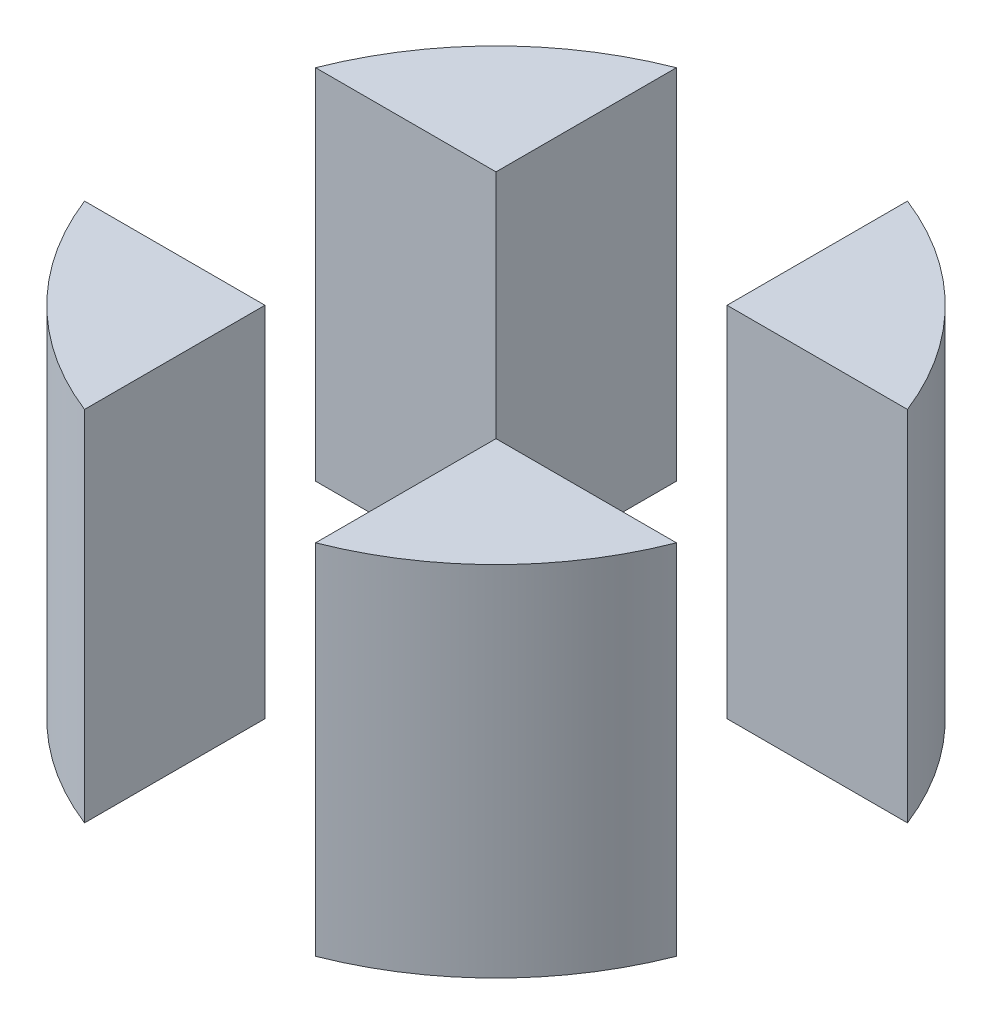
ISO-10303-21;
HEADER;
FILE_DESCRIPTION(('STEP AP214'),'2;1');
FILE_NAME('part.step','',(''),(''),'','','');
FILE_SCHEMA(('AUTOMOTIVE_DESIGN { 1 0 10303 214 1 1 1 1 }'));
ENDSEC;
DATA;
#1=APPLICATION_CONTEXT('core data for automotive mechanical design processes');
#2=APPLICATION_PROTOCOL_DEFINITION('international standard','automotive_design',2000,#1);
#3=PRODUCT_CONTEXT('',#1,'mechanical');
#4=PRODUCT('Part','Part','',(#3));
#5=PRODUCT_RELATED_PRODUCT_CATEGORY('part','',(#4));
#6=PRODUCT_DEFINITION_FORMATION('','',#4);
#7=PRODUCT_DEFINITION_CONTEXT('part definition',#1,'design');
#8=PRODUCT_DEFINITION('design','',#6,#7);
#9=PRODUCT_DEFINITION_SHAPE('','',#8);
#10=(LENGTH_UNIT() NAMED_UNIT(*) SI_UNIT(.MILLI.,.METRE.));
#11=(NAMED_UNIT(*) PLANE_ANGLE_UNIT() SI_UNIT($,.RADIAN.));
#12=(NAMED_UNIT(*) SI_UNIT($,.STERADIAN.) SOLID_ANGLE_UNIT());
#13=UNCERTAINTY_MEASURE_WITH_UNIT(LENGTH_MEASURE(1.E-05),#10,'distance_accuracy_value','');
#14=(GEOMETRIC_REPRESENTATION_CONTEXT(3) GLOBAL_UNCERTAINTY_ASSIGNED_CONTEXT((#13)) GLOBAL_UNIT_ASSIGNED_CONTEXT((#10,
#11,#12)) REPRESENTATION_CONTEXT('',''));
#15=CARTESIAN_POINT('',(0.,0.,0.));
#16=DIRECTION('',(0.,0.,1.));
#17=DIRECTION('',(1.,0.,0.));
#18=AXIS2_PLACEMENT_3D('',#15,#16,#17);
#19=CARTESIAN_POINT('',(-10.,23.,10.));
#20=DIRECTION('',(0.,0.,-1.));
#21=DIRECTION('',(-1.,0.,0.));
#22=AXIS2_PLACEMENT_3D('',#19,#20,#21);
#23=PLANE('',#22);
#24=DIRECTION('',(0.,-1.,0.));
#25=VECTOR('',#24,1.);
#26=CARTESIAN_POINT('',(25.617376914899,57.9993507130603,9.99999999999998));
#27=LINE('',#26,#25);
#28=CARTESIAN_POINT('',(25.617376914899,0.,9.99999999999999));
#29=VERTEX_POINT('',#28);
#30=CARTESIAN_POINT('',(25.617376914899,30.9987014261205,9.99999999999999));
#31=VERTEX_POINT('',#30);
#32=EDGE_CURVE('P0_E51',#29,#31,#27,.F.);
#33=ORIENTED_EDGE('',*,*,#32,.F.);
#34=DIRECTION('',(1.,0.,0.));
#35=VECTOR('',#34,1.);
#36=CARTESIAN_POINT('',(0.,0.,10.));
#37=LINE('',#36,#35);
#38=CARTESIAN_POINT('',(10.,0.,10.));
#39=VERTEX_POINT('',#38);
#40=EDGE_CURVE('P0_E63',#29,#39,#37,.F.);
#41=ORIENTED_EDGE('',*,*,#40,.T.);
#42=DIRECTION('',(0.,1.,0.));
#43=VECTOR('',#42,1.);
#44=CARTESIAN_POINT('',(10.,15.9987014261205,10.));
#45=LINE('',#44,#43);
#46=CARTESIAN_POINT('',(10.,30.9987014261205,10.));
#47=VERTEX_POINT('',#46);
#48=EDGE_CURVE('P0_E53',#47,#39,#45,.F.);
#49=ORIENTED_EDGE('',*,*,#48,.F.);
#50=DIRECTION('',(1.,0.,0.));
#51=VECTOR('',#50,1.);
#52=CARTESIAN_POINT('',(0.,30.9987014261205,10.));
#53=LINE('',#52,#51);
#54=EDGE_CURVE('P0_E47',#47,#31,#53,.T.);
#55=ORIENTED_EDGE('',*,*,#54,.T.);
#56=EDGE_LOOP('',(#33,#41,#49,#55));
#57=FACE_BOUND('',#56,.T.);
#58=ADVANCED_FACE('P0_F16',(#57),#23,.T.);
#59=CARTESIAN_POINT('',(0.,30.9987014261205,0.));
#60=DIRECTION('',(0.,-1.,0.));
#61=DIRECTION('',(0.,0.,-1.));
#62=AXIS2_PLACEMENT_3D('',#59,#60,#61);
#63=PLANE('',#62);
#64=DIRECTION('',(0.,0.,1.));
#65=VECTOR('',#64,1.);
#66=CARTESIAN_POINT('',(10.,30.9987014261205,10.));
#67=LINE('',#66,#65);
#68=CARTESIAN_POINT('',(10.,30.9987014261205,25.617376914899));
#69=VERTEX_POINT('',#68);
#70=EDGE_CURVE('P0_E56',#69,#47,#67,.F.);
#71=ORIENTED_EDGE('',*,*,#70,.F.);
#72=CARTESIAN_POINT('',(0.,30.9987014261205,0.));
#73=DIRECTION('',(0.,-1.,0.));
#74=DIRECTION('',(1.,0.,0.));
#75=AXIS2_PLACEMENT_3D('',#72,#73,#74);
#76=CIRCLE('',#75,27.5);
#77=EDGE_CURVE('P0_E19',#31,#69,#76,.T.);
#78=ORIENTED_EDGE('',*,*,#77,.F.);
#79=ORIENTED_EDGE('',*,*,#54,.F.);
#80=EDGE_LOOP('',(#71,#78,#79));
#81=FACE_BOUND('',#80,.T.);
#82=ADVANCED_FACE('P0_F59',(#81),#63,.F.);
#83=CARTESIAN_POINT('',(10.,15.9987014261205,10.));
#84=DIRECTION('',(-1.,0.,0.));
#85=DIRECTION('',(0.,0.,1.));
#86=AXIS2_PLACEMENT_3D('',#83,#84,#85);
#87=PLANE('',#86);
#88=ORIENTED_EDGE('',*,*,#48,.T.);
#89=DIRECTION('',(0.,0.,1.));
#90=VECTOR('',#89,1.);
#91=CARTESIAN_POINT('',(10.,0.,0.));
#92=LINE('',#91,#90);
#93=CARTESIAN_POINT('',(10.,0.,25.617376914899));
#94=VERTEX_POINT('',#93);
#95=EDGE_CURVE('P0_E32',#39,#94,#92,.T.);
#96=ORIENTED_EDGE('',*,*,#95,.T.);
#97=DIRECTION('',(0.,-1.,0.));
#98=VECTOR('',#97,1.);
#99=CARTESIAN_POINT('',(10.,57.9993507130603,25.617376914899));
#100=LINE('',#99,#98);
#101=EDGE_CURVE('P0_E25',#69,#94,#100,.T.);
#102=ORIENTED_EDGE('',*,*,#101,.F.);
#103=ORIENTED_EDGE('',*,*,#70,.T.);
#104=EDGE_LOOP('',(#88,#96,#102,#103));
#105=FACE_BOUND('',#104,.T.);
#106=ADVANCED_FACE('P0_F70',(#105),#87,.T.);
#107=CARTESIAN_POINT('',(0.,0.,0.));
#108=DIRECTION('',(0.,1.,0.));
#109=DIRECTION('',(0.,0.,1.));
#110=AXIS2_PLACEMENT_3D('',#107,#108,#109);
#111=PLANE('',#110);
#112=CARTESIAN_POINT('',(0.,0.,0.));
#113=DIRECTION('',(0.,-1.,0.));
#114=DIRECTION('',(1.,0.,0.));
#115=AXIS2_PLACEMENT_3D('',#112,#113,#114);
#116=CIRCLE('',#115,27.5);
#117=EDGE_CURVE('P0_E11',#94,#29,#116,.F.);
#118=ORIENTED_EDGE('',*,*,#117,.F.);
#119=ORIENTED_EDGE('',*,*,#95,.F.);
#120=ORIENTED_EDGE('',*,*,#40,.F.);
#121=EDGE_LOOP('',(#118,#119,#120));
#122=FACE_BOUND('',#121,.T.);
#123=ADVANCED_FACE('P0_F72',(#122),#111,.F.);
#124=CARTESIAN_POINT('',(0.,57.9993507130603,0.));
#125=DIRECTION('',(0.,-1.,0.));
#126=DIRECTION('',(1.,0.,0.));
#127=AXIS2_PLACEMENT_3D('',#124,#125,#126);
#128=CYLINDRICAL_SURFACE('',#127,27.5);
#129=ORIENTED_EDGE('',*,*,#101,.T.);
#130=ORIENTED_EDGE('',*,*,#117,.T.);
#131=ORIENTED_EDGE('',*,*,#32,.T.);
#132=ORIENTED_EDGE('',*,*,#77,.T.);
#133=EDGE_LOOP('',(#129,#130,#131,#132));
#134=FACE_BOUND('',#133,.T.);
#135=ADVANCED_FACE('P0_F62',(#134),#128,.T.);
#136=CLOSED_SHELL('',(#58,#82,#106,#123,#135));
#137=MANIFOLD_SOLID_BREP('P0_B1',#136);
#138=CARTESIAN_POINT('',(-10.,23.,-10.));
#139=DIRECTION('',(0.,0.,1.));
#140=DIRECTION('',(1.,0.,0.));
#141=AXIS2_PLACEMENT_3D('',#138,#139,#140);
#142=PLANE('',#141);
#143=DIRECTION('',(0.,-1.,0.));
#144=VECTOR('',#143,1.);
#145=CARTESIAN_POINT('',(-25.617376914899,57.9993507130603,-9.99999999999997));
#146=LINE('',#145,#144);
#147=CARTESIAN_POINT('',(-25.617376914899,0.,-9.99999999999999));
#148=VERTEX_POINT('',#147);
#149=CARTESIAN_POINT('',(-25.617376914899,30.9987014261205,-9.99999999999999));
#150=VERTEX_POINT('',#149);
#151=EDGE_CURVE('P1_E51',#148,#150,#146,.F.);
#152=ORIENTED_EDGE('',*,*,#151,.F.);
#153=DIRECTION('',(1.,0.,0.));
#154=VECTOR('',#153,1.);
#155=CARTESIAN_POINT('',(0.,0.,-10.));
#156=LINE('',#155,#154);
#157=CARTESIAN_POINT('',(-10.,0.,-10.));
#158=VERTEX_POINT('',#157);
#159=EDGE_CURVE('P1_E64',#148,#158,#156,.T.);
#160=ORIENTED_EDGE('',*,*,#159,.T.);
#161=DIRECTION('',(0.,1.,0.));
#162=VECTOR('',#161,1.);
#163=CARTESIAN_POINT('',(-10.,15.9987014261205,-10.));
#164=LINE('',#163,#162);
#165=CARTESIAN_POINT('',(-10.,30.9987014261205,-10.));
#166=VERTEX_POINT('',#165);
#167=EDGE_CURVE('P1_E53',#166,#158,#164,.F.);
#168=ORIENTED_EDGE('',*,*,#167,.F.);
#169=DIRECTION('',(1.,0.,0.));
#170=VECTOR('',#169,1.);
#171=CARTESIAN_POINT('',(0.,30.9987014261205,-10.));
#172=LINE('',#171,#170);
#173=EDGE_CURVE('P1_E47',#166,#150,#172,.F.);
#174=ORIENTED_EDGE('',*,*,#173,.T.);
#175=EDGE_LOOP('',(#152,#160,#168,#174));
#176=FACE_BOUND('',#175,.T.);
#177=ADVANCED_FACE('P1_F16',(#176),#142,.T.);
#178=CARTESIAN_POINT('',(0.,30.9987014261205,0.));
#179=DIRECTION('',(0.,-1.,0.));
#180=DIRECTION('',(0.,0.,-1.));
#181=AXIS2_PLACEMENT_3D('',#178,#179,#180);
#182=PLANE('',#181);
#183=CARTESIAN_POINT('',(0.,30.9987014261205,0.));
#184=DIRECTION('',(0.,-1.,0.));
#185=DIRECTION('',(1.,0.,0.));
#186=AXIS2_PLACEMENT_3D('',#183,#184,#185);
#187=CIRCLE('',#186,27.5);
#188=CARTESIAN_POINT('',(-10.,30.9987014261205,-25.617376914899));
#189=VERTEX_POINT('',#188);
#190=EDGE_CURVE('P1_E19',#150,#189,#187,.T.);
#191=ORIENTED_EDGE('',*,*,#190,.F.);
#192=ORIENTED_EDGE('',*,*,#173,.F.);
#193=DIRECTION('',(0.,0.,-1.));
#194=VECTOR('',#193,1.);
#195=CARTESIAN_POINT('',(-10.,30.9987014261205,10.));
#196=LINE('',#195,#194);
#197=EDGE_CURVE('P1_E56',#189,#166,#196,.F.);
#198=ORIENTED_EDGE('',*,*,#197,.F.);
#199=EDGE_LOOP('',(#191,#192,#198));
#200=FACE_BOUND('',#199,.T.);
#201=ADVANCED_FACE('P1_F59',(#200),#182,.F.);
#202=CARTESIAN_POINT('',(-10.,15.9987014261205,10.));
#203=DIRECTION('',(1.,0.,0.));
#204=DIRECTION('',(0.,0.,-1.));
#205=AXIS2_PLACEMENT_3D('',#202,#203,#204);
#206=PLANE('',#205);
#207=ORIENTED_EDGE('',*,*,#167,.T.);
#208=DIRECTION('',(0.,0.,1.));
#209=VECTOR('',#208,1.);
#210=CARTESIAN_POINT('',(-10.,0.,0.));
#211=LINE('',#210,#209);
#212=CARTESIAN_POINT('',(-10.,0.,-25.617376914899));
#213=VERTEX_POINT('',#212);
#214=EDGE_CURVE('P1_E32',#158,#213,#211,.F.);
#215=ORIENTED_EDGE('',*,*,#214,.T.);
#216=DIRECTION('',(0.,-1.,0.));
#217=VECTOR('',#216,1.);
#218=CARTESIAN_POINT('',(-10.,57.9993507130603,-25.617376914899));
#219=LINE('',#218,#217);
#220=EDGE_CURVE('P1_E25',#189,#213,#219,.T.);
#221=ORIENTED_EDGE('',*,*,#220,.F.);
#222=ORIENTED_EDGE('',*,*,#197,.T.);
#223=EDGE_LOOP('',(#207,#215,#221,#222));
#224=FACE_BOUND('',#223,.T.);
#225=ADVANCED_FACE('P1_F72',(#224),#206,.T.);
#226=CARTESIAN_POINT('',(0.,0.,0.));
#227=DIRECTION('',(0.,1.,0.));
#228=DIRECTION('',(0.,0.,1.));
#229=AXIS2_PLACEMENT_3D('',#226,#227,#228);
#230=PLANE('',#229);
#231=ORIENTED_EDGE('',*,*,#159,.F.);
#232=CARTESIAN_POINT('',(0.,0.,0.));
#233=DIRECTION('',(0.,-1.,0.));
#234=DIRECTION('',(1.,0.,0.));
#235=AXIS2_PLACEMENT_3D('',#232,#233,#234);
#236=CIRCLE('',#235,27.5);
#237=EDGE_CURVE('P1_E11',#213,#148,#236,.F.);
#238=ORIENTED_EDGE('',*,*,#237,.F.);
#239=ORIENTED_EDGE('',*,*,#214,.F.);
#240=EDGE_LOOP('',(#231,#238,#239));
#241=FACE_BOUND('',#240,.T.);
#242=ADVANCED_FACE('P1_F71',(#241),#230,.F.);
#243=CARTESIAN_POINT('',(0.,57.9993507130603,0.));
#244=DIRECTION('',(0.,-1.,0.));
#245=DIRECTION('',(1.,0.,0.));
#246=AXIS2_PLACEMENT_3D('',#243,#244,#245);
#247=CYLINDRICAL_SURFACE('',#246,27.5);
#248=ORIENTED_EDGE('',*,*,#220,.T.);
#249=ORIENTED_EDGE('',*,*,#237,.T.);
#250=ORIENTED_EDGE('',*,*,#151,.T.);
#251=ORIENTED_EDGE('',*,*,#190,.T.);
#252=EDGE_LOOP('',(#248,#249,#250,#251));
#253=FACE_BOUND('',#252,.T.);
#254=ADVANCED_FACE('P1_F62',(#253),#247,.T.);
#255=CLOSED_SHELL('',(#177,#201,#225,#242,#254));
#256=MANIFOLD_SOLID_BREP('P1_B1',#255);
#257=CARTESIAN_POINT('',(10.,15.9987014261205,10.));
#258=DIRECTION('',(-1.,0.,0.));
#259=DIRECTION('',(0.,0.,1.));
#260=AXIS2_PLACEMENT_3D('',#257,#258,#259);
#261=PLANE('',#260);
#262=DIRECTION('',(0.,-1.,0.));
#263=VECTOR('',#262,1.);
#264=CARTESIAN_POINT('',(9.99999999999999,57.9993507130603,-25.617376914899));
#265=LINE('',#264,#263);
#266=CARTESIAN_POINT('',(9.99999999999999,0.,-25.617376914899));
#267=VERTEX_POINT('',#266);
#268=CARTESIAN_POINT('',(10.,30.9987014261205,-25.617376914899));
#269=VERTEX_POINT('',#268);
#270=EDGE_CURVE('P2_E51',#267,#269,#265,.F.);
#271=ORIENTED_EDGE('',*,*,#270,.F.);
#272=DIRECTION('',(0.,0.,1.));
#273=VECTOR('',#272,1.);
#274=CARTESIAN_POINT('',(10.,0.,0.));
#275=LINE('',#274,#273);
#276=CARTESIAN_POINT('',(10.,0.,-10.));
#277=VERTEX_POINT('',#276);
#278=EDGE_CURVE('P2_E64',#267,#277,#275,.T.);
#279=ORIENTED_EDGE('',*,*,#278,.T.);
#280=DIRECTION('',(0.,1.,0.));
#281=VECTOR('',#280,1.);
#282=CARTESIAN_POINT('',(10.,23.,-10.));
#283=LINE('',#282,#281);
#284=CARTESIAN_POINT('',(10.,30.9987014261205,-10.));
#285=VERTEX_POINT('',#284);
#286=EDGE_CURVE('P2_E53',#285,#277,#283,.F.);
#287=ORIENTED_EDGE('',*,*,#286,.F.);
#288=DIRECTION('',(0.,0.,-1.));
#289=VECTOR('',#288,1.);
#290=CARTESIAN_POINT('',(10.,30.9987014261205,0.));
#291=LINE('',#290,#289);
#292=EDGE_CURVE('P2_E47',#285,#269,#291,.T.);
#293=ORIENTED_EDGE('',*,*,#292,.T.);
#294=EDGE_LOOP('',(#271,#279,#287,#293));
#295=FACE_BOUND('',#294,.T.);
#296=ADVANCED_FACE('P2_F16',(#295),#261,.T.);
#297=CARTESIAN_POINT('',(0.,30.9987014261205,0.));
#298=DIRECTION('',(0.,-1.,0.));
#299=DIRECTION('',(0.,0.,-1.));
#300=AXIS2_PLACEMENT_3D('',#297,#298,#299);
#301=PLANE('',#300);
#302=CARTESIAN_POINT('',(0.,30.9987014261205,0.));
#303=DIRECTION('',(0.,-1.,0.));
#304=DIRECTION('',(1.,0.,0.));
#305=AXIS2_PLACEMENT_3D('',#302,#303,#304);
#306=CIRCLE('',#305,27.5);
#307=CARTESIAN_POINT('',(25.617376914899,30.9987014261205,-9.99999999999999));
#308=VERTEX_POINT('',#307);
#309=EDGE_CURVE('P2_E19',#269,#308,#306,.T.);
#310=ORIENTED_EDGE('',*,*,#309,.F.);
#311=ORIENTED_EDGE('',*,*,#292,.F.);
#312=DIRECTION('',(1.,0.,0.));
#313=VECTOR('',#312,1.);
#314=CARTESIAN_POINT('',(-10.,30.9987014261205,-10.));
#315=LINE('',#314,#313);
#316=EDGE_CURVE('P2_E56',#308,#285,#315,.F.);
#317=ORIENTED_EDGE('',*,*,#316,.F.);
#318=EDGE_LOOP('',(#310,#311,#317));
#319=FACE_BOUND('',#318,.T.);
#320=ADVANCED_FACE('P2_F59',(#319),#301,.F.);
#321=CARTESIAN_POINT('',(-10.,23.,-10.));
#322=DIRECTION('',(0.,0.,1.));
#323=DIRECTION('',(1.,0.,0.));
#324=AXIS2_PLACEMENT_3D('',#321,#322,#323);
#325=PLANE('',#324);
#326=ORIENTED_EDGE('',*,*,#286,.T.);
#327=DIRECTION('',(1.,0.,0.));
#328=VECTOR('',#327,1.);
#329=CARTESIAN_POINT('',(0.,0.,-10.));
#330=LINE('',#329,#328);
#331=CARTESIAN_POINT('',(25.617376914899,0.,-9.99999999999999));
#332=VERTEX_POINT('',#331);
#333=EDGE_CURVE('P2_E32',#277,#332,#330,.T.);
#334=ORIENTED_EDGE('',*,*,#333,.T.);
#335=DIRECTION('',(0.,-1.,0.));
#336=VECTOR('',#335,1.);
#337=CARTESIAN_POINT('',(25.617376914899,57.9993507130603,-9.99999999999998));
#338=LINE('',#337,#336);
#339=EDGE_CURVE('P2_E25',#308,#332,#338,.T.);
#340=ORIENTED_EDGE('',*,*,#339,.F.);
#341=ORIENTED_EDGE('',*,*,#316,.T.);
#342=EDGE_LOOP('',(#326,#334,#340,#341));
#343=FACE_BOUND('',#342,.T.);
#344=ADVANCED_FACE('P2_F72',(#343),#325,.T.);
#345=CARTESIAN_POINT('',(0.,0.,0.));
#346=DIRECTION('',(0.,1.,0.));
#347=DIRECTION('',(0.,0.,1.));
#348=AXIS2_PLACEMENT_3D('',#345,#346,#347);
#349=PLANE('',#348);
#350=ORIENTED_EDGE('',*,*,#278,.F.);
#351=CARTESIAN_POINT('',(0.,0.,0.));
#352=DIRECTION('',(0.,-1.,0.));
#353=DIRECTION('',(1.,0.,0.));
#354=AXIS2_PLACEMENT_3D('',#351,#352,#353);
#355=CIRCLE('',#354,27.5);
#356=EDGE_CURVE('P2_E11',#332,#267,#355,.F.);
#357=ORIENTED_EDGE('',*,*,#356,.F.);
#358=ORIENTED_EDGE('',*,*,#333,.F.);
#359=EDGE_LOOP('',(#350,#357,#358));
#360=FACE_BOUND('',#359,.T.);
#361=ADVANCED_FACE('P2_F71',(#360),#349,.F.);
#362=CARTESIAN_POINT('',(0.,57.9993507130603,0.));
#363=DIRECTION('',(0.,-1.,0.));
#364=DIRECTION('',(1.,0.,0.));
#365=AXIS2_PLACEMENT_3D('',#362,#363,#364);
#366=CYLINDRICAL_SURFACE('',#365,27.5);
#367=ORIENTED_EDGE('',*,*,#339,.T.);
#368=ORIENTED_EDGE('',*,*,#356,.T.);
#369=ORIENTED_EDGE('',*,*,#270,.T.);
#370=ORIENTED_EDGE('',*,*,#309,.T.);
#371=EDGE_LOOP('',(#367,#368,#369,#370));
#372=FACE_BOUND('',#371,.T.);
#373=ADVANCED_FACE('P2_F62',(#372),#366,.T.);
#374=CLOSED_SHELL('',(#296,#320,#344,#361,#373));
#375=MANIFOLD_SOLID_BREP('P2_B1',#374);
#376=CARTESIAN_POINT('',(-10.,15.9987014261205,10.));
#377=DIRECTION('',(1.,0.,0.));
#378=DIRECTION('',(0.,0.,-1.));
#379=AXIS2_PLACEMENT_3D('',#376,#377,#378);
#380=PLANE('',#379);
#381=DIRECTION('',(0.,-1.,0.));
#382=VECTOR('',#381,1.);
#383=CARTESIAN_POINT('',(-9.99999999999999,57.9993507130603,25.617376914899));
#384=LINE('',#383,#382);
#385=CARTESIAN_POINT('',(-10.,0.,25.617376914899));
#386=VERTEX_POINT('',#385);
#387=CARTESIAN_POINT('',(-10.,30.9987014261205,25.617376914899));
#388=VERTEX_POINT('',#387);
#389=EDGE_CURVE('P3_E51',#386,#388,#384,.F.);
#390=ORIENTED_EDGE('',*,*,#389,.F.);
#391=DIRECTION('',(0.,0.,1.));
#392=VECTOR('',#391,1.);
#393=CARTESIAN_POINT('',(-10.,0.,0.));
#394=LINE('',#393,#392);
#395=CARTESIAN_POINT('',(-10.,0.,10.));
#396=VERTEX_POINT('',#395);
#397=EDGE_CURVE('P3_E63',#386,#396,#394,.F.);
#398=ORIENTED_EDGE('',*,*,#397,.T.);
#399=DIRECTION('',(0.,1.,0.));
#400=VECTOR('',#399,1.);
#401=CARTESIAN_POINT('',(-10.,23.,10.));
#402=LINE('',#401,#400);
#403=CARTESIAN_POINT('',(-10.,30.9987014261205,10.));
#404=VERTEX_POINT('',#403);
#405=EDGE_CURVE('P3_E53',#404,#396,#402,.F.);
#406=ORIENTED_EDGE('',*,*,#405,.F.);
#407=DIRECTION('',(0.,0.,-1.));
#408=VECTOR('',#407,1.);
#409=CARTESIAN_POINT('',(-10.,30.9987014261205,0.));
#410=LINE('',#409,#408);
#411=EDGE_CURVE('P3_E47',#404,#388,#410,.F.);
#412=ORIENTED_EDGE('',*,*,#411,.T.);
#413=EDGE_LOOP('',(#390,#398,#406,#412));
#414=FACE_BOUND('',#413,.T.);
#415=ADVANCED_FACE('P3_F16',(#414),#380,.T.);
#416=CARTESIAN_POINT('',(0.,30.9987014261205,0.));
#417=DIRECTION('',(0.,-1.,0.));
#418=DIRECTION('',(0.,0.,-1.));
#419=AXIS2_PLACEMENT_3D('',#416,#417,#418);
#420=PLANE('',#419);
#421=DIRECTION('',(-1.,0.,0.));
#422=VECTOR('',#421,1.);
#423=CARTESIAN_POINT('',(-10.,30.9987014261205,10.));
#424=LINE('',#423,#422);
#425=CARTESIAN_POINT('',(-25.617376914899,30.9987014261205,9.99999999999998));
#426=VERTEX_POINT('',#425);
#427=EDGE_CURVE('P3_E56',#426,#404,#424,.F.);
#428=ORIENTED_EDGE('',*,*,#427,.F.);
#429=CARTESIAN_POINT('',(0.,30.9987014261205,0.));
#430=DIRECTION('',(0.,-1.,0.));
#431=DIRECTION('',(1.,0.,0.));
#432=AXIS2_PLACEMENT_3D('',#429,#430,#431);
#433=CIRCLE('',#432,27.5);
#434=EDGE_CURVE('P3_E19',#388,#426,#433,.T.);
#435=ORIENTED_EDGE('',*,*,#434,.F.);
#436=ORIENTED_EDGE('',*,*,#411,.F.);
#437=EDGE_LOOP('',(#428,#435,#436));
#438=FACE_BOUND('',#437,.T.);
#439=ADVANCED_FACE('P3_F59',(#438),#420,.F.);
#440=CARTESIAN_POINT('',(-10.,23.,10.));
#441=DIRECTION('',(0.,0.,-1.));
#442=DIRECTION('',(-1.,0.,0.));
#443=AXIS2_PLACEMENT_3D('',#440,#441,#442);
#444=PLANE('',#443);
#445=ORIENTED_EDGE('',*,*,#405,.T.);
#446=DIRECTION('',(1.,0.,0.));
#447=VECTOR('',#446,1.);
#448=CARTESIAN_POINT('',(0.,0.,10.));
#449=LINE('',#448,#447);
#450=CARTESIAN_POINT('',(-25.617376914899,0.,9.99999999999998));
#451=VERTEX_POINT('',#450);
#452=EDGE_CURVE('P3_E32',#396,#451,#449,.F.);
#453=ORIENTED_EDGE('',*,*,#452,.T.);
#454=DIRECTION('',(0.,-1.,0.));
#455=VECTOR('',#454,1.);
#456=CARTESIAN_POINT('',(-25.617376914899,57.9993507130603,9.99999999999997));
#457=LINE('',#456,#455);
#458=EDGE_CURVE('P3_E25',#426,#451,#457,.T.);
#459=ORIENTED_EDGE('',*,*,#458,.F.);
#460=ORIENTED_EDGE('',*,*,#427,.T.);
#461=EDGE_LOOP('',(#445,#453,#459,#460));
#462=FACE_BOUND('',#461,.T.);
#463=ADVANCED_FACE('P3_F70',(#462),#444,.T.);
#464=CARTESIAN_POINT('',(0.,0.,0.));
#465=DIRECTION('',(0.,1.,0.));
#466=DIRECTION('',(0.,0.,1.));
#467=AXIS2_PLACEMENT_3D('',#464,#465,#466);
#468=PLANE('',#467);
#469=CARTESIAN_POINT('',(0.,0.,0.));
#470=DIRECTION('',(0.,-1.,0.));
#471=DIRECTION('',(1.,0.,0.));
#472=AXIS2_PLACEMENT_3D('',#469,#470,#471);
#473=CIRCLE('',#472,27.5);
#474=EDGE_CURVE('P3_E11',#451,#386,#473,.F.);
#475=ORIENTED_EDGE('',*,*,#474,.F.);
#476=ORIENTED_EDGE('',*,*,#452,.F.);
#477=ORIENTED_EDGE('',*,*,#397,.F.);
#478=EDGE_LOOP('',(#475,#476,#477));
#479=FACE_BOUND('',#478,.T.);
#480=ADVANCED_FACE('P3_F72',(#479),#468,.F.);
#481=CARTESIAN_POINT('',(0.,57.9993507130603,0.));
#482=DIRECTION('',(0.,-1.,0.));
#483=DIRECTION('',(1.,0.,0.));
#484=AXIS2_PLACEMENT_3D('',#481,#482,#483);
#485=CYLINDRICAL_SURFACE('',#484,27.5);
#486=ORIENTED_EDGE('',*,*,#458,.T.);
#487=ORIENTED_EDGE('',*,*,#474,.T.);
#488=ORIENTED_EDGE('',*,*,#389,.T.);
#489=ORIENTED_EDGE('',*,*,#434,.T.);
#490=EDGE_LOOP('',(#486,#487,#488,#489));
#491=FACE_BOUND('',#490,.T.);
#492=ADVANCED_FACE('P3_F62',(#491),#485,.T.);
#493=CLOSED_SHELL('',(#415,#439,#463,#480,#492));
#494=MANIFOLD_SOLID_BREP('P3_B1',#493);
#495=ADVANCED_BREP_SHAPE_REPRESENTATION('',(#18,#137,#256,#375,#494),#14);
#496=SHAPE_DEFINITION_REPRESENTATION(#9,#495);
ENDSEC;
END-ISO-10303-21;
